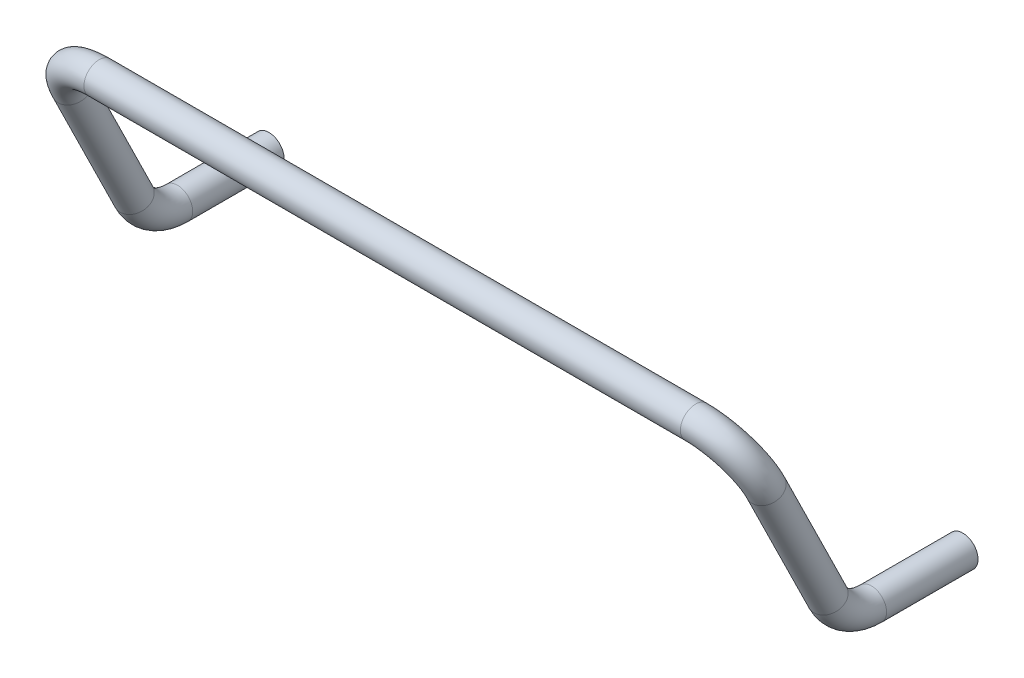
ISO-10303-21;
HEADER;
FILE_DESCRIPTION(('STEP AP214'),'2;1');
FILE_NAME('part.step','',(''),(''),'','','');
FILE_SCHEMA(('AUTOMOTIVE_DESIGN { 1 0 10303 214 1 1 1 1 }'));
ENDSEC;
DATA;
#1=APPLICATION_CONTEXT('core data for automotive mechanical design processes');
#2=APPLICATION_PROTOCOL_DEFINITION('international standard','automotive_design',2000,#1);
#3=PRODUCT_CONTEXT('',#1,'mechanical');
#4=PRODUCT('Part','Part','',(#3));
#5=PRODUCT_RELATED_PRODUCT_CATEGORY('part','',(#4));
#6=PRODUCT_DEFINITION_FORMATION('','',#4);
#7=PRODUCT_DEFINITION_CONTEXT('part definition',#1,'design');
#8=PRODUCT_DEFINITION('design','',#6,#7);
#9=PRODUCT_DEFINITION_SHAPE('','',#8);
#10=(LENGTH_UNIT() NAMED_UNIT(*) SI_UNIT(.MILLI.,.METRE.));
#11=(NAMED_UNIT(*) PLANE_ANGLE_UNIT() SI_UNIT($,.RADIAN.));
#12=(NAMED_UNIT(*) SI_UNIT($,.STERADIAN.) SOLID_ANGLE_UNIT());
#13=UNCERTAINTY_MEASURE_WITH_UNIT(LENGTH_MEASURE(1.E-05),#10,'distance_accuracy_value','');
#14=(GEOMETRIC_REPRESENTATION_CONTEXT(3) GLOBAL_UNCERTAINTY_ASSIGNED_CONTEXT((#13)) GLOBAL_UNIT_ASSIGNED_CONTEXT((#10,
#11,#12)) REPRESENTATION_CONTEXT('',''));
#15=CARTESIAN_POINT('',(0.,0.,0.));
#16=DIRECTION('',(0.,0.,1.));
#17=DIRECTION('',(1.,0.,0.));
#18=AXIS2_PLACEMENT_3D('',#15,#16,#17);
#19=CARTESIAN_POINT('',(40.,161.493988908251,179.49648763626));
#20=DIRECTION('',(1.,0.,0.));
#21=DIRECTION('',(0.,0.,-1.));
#22=AXIS2_PLACEMENT_3D('',#19,#20,#21);
#23=CYLINDRICAL_SURFACE('',#22,12.5);
#24=CARTESIAN_POINT('',(40.,161.493988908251,179.49648763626));
#25=DIRECTION('',(1.,0.,0.));
#26=DIRECTION('',(0.,-0.897188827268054,-0.441647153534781));
#27=AXIS2_PLACEMENT_3D('',#24,#25,#26);
#28=CIRCLE('',#27,12.5);
#29=CARTESIAN_POINT('',(40.,172.708849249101,185.017077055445));
#30=VERTEX_POINT('',#29);
#31=EDGE_CURVE('E10',#30,#30,#28,.T.);
#32=ORIENTED_EDGE('',*,*,#31,.T.);
#33=EDGE_LOOP('',(#32));
#34=FACE_BOUND('',#33,.T.);
#35=CARTESIAN_POINT('',(530.,161.49398890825,179.49648763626));
#36=DIRECTION('',(1.,0.,0.));
#37=DIRECTION('',(0.,-0.897188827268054,-0.441647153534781));
#38=AXIS2_PLACEMENT_3D('',#35,#36,#37);
#39=CIRCLE('',#38,12.5);
#40=CARTESIAN_POINT('',(530.,172.708849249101,185.017077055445));
#41=VERTEX_POINT('',#40);
#42=EDGE_CURVE('E69',#41,#41,#39,.T.);
#43=ORIENTED_EDGE('',*,*,#42,.F.);
#44=EDGE_LOOP('',(#43));
#45=FACE_BOUND('',#44,.T.);
#46=ADVANCED_FACE('F32',(#34,#45),#23,.T.);
#47=CARTESIAN_POINT('',(40.,161.493988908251,179.49648763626));
#48=DIRECTION('',(1.,0.,0.));
#49=DIRECTION('',(0.,0.,-1.));
#50=AXIS2_PLACEMENT_3D('',#47,#48,#49);
#51=CYLINDRICAL_SURFACE('',#50,11.);
#52=CARTESIAN_POINT('',(40.,161.493988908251,179.49648763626));
#53=DIRECTION('',(1.,0.,0.));
#54=DIRECTION('',(0.,-0.897188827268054,-0.441647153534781));
#55=AXIS2_PLACEMENT_3D('',#52,#53,#54);
#56=CIRCLE('',#55,11.);
#57=CARTESIAN_POINT('',(40.,171.363066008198,184.354606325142));
#58=VERTEX_POINT('',#57);
#59=EDGE_CURVE('E38',#58,#58,#56,.T.);
#60=ORIENTED_EDGE('',*,*,#59,.F.);
#61=EDGE_LOOP('',(#60));
#62=FACE_BOUND('',#61,.T.);
#63=CARTESIAN_POINT('',(530.,161.49398890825,179.49648763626));
#64=DIRECTION('',(1.,0.,0.));
#65=DIRECTION('',(0.,-0.897188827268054,-0.441647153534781));
#66=AXIS2_PLACEMENT_3D('',#63,#64,#65);
#67=CIRCLE('',#66,11.);
#68=CARTESIAN_POINT('',(530.,171.363066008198,184.354606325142));
#69=VERTEX_POINT('',#68);
#70=EDGE_CURVE('E72',#69,#69,#67,.T.);
#71=ORIENTED_EDGE('',*,*,#70,.T.);
#72=EDGE_LOOP('',(#71));
#73=FACE_BOUND('',#72,.T.);
#74=ADVANCED_FACE('F119',(#62,#73),#51,.F.);
#75=CARTESIAN_POINT('',(40.,125.606435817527,161.830601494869));
#76=DIRECTION('',(0.,0.441647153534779,-0.897188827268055));
#77=DIRECTION('',(0.,0.897188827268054,0.441647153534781));
#78=AXIS2_PLACEMENT_3D('',#75,#76,#77);
#79=TOROIDAL_SURFACE('',#78,40.,12.5);
#80=CARTESIAN_POINT('',(0.,125.606435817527,161.830601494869));
#81=DIRECTION('',(0.,0.897188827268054,0.44164715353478));
#82=DIRECTION('',(1.,0.,0.));
#83=AXIS2_PLACEMENT_3D('',#80,#81,#82);
#84=CIRCLE('',#83,12.5);
#85=CARTESIAN_POINT('',(-12.5,125.606435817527,161.830601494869));
#86=VERTEX_POINT('',#85);
#87=EDGE_CURVE('E42',#86,#86,#84,.T.);
#88=CARTESIAN_POINT('',(40.,125.606435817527,161.830601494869));
#89=DIRECTION('',(0.,0.441647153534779,-0.897188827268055));
#90=DIRECTION('',(0.,0.897188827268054,0.441647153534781));
#91=AXIS2_PLACEMENT_3D('',#88,#89,#90);
#92=CIRCLE('',#91,52.5);
#93=EDGE_CURVE('',#86,#30,#92,.T.);
#94=ORIENTED_EDGE('',*,*,#87,.T.);
#95=ORIENTED_EDGE('',*,*,#31,.F.);
#96=ORIENTED_EDGE('',*,*,#93,.T.);
#97=ORIENTED_EDGE('',*,*,#93,.F.);
#98=EDGE_LOOP('',(#94,#96,#95,#97));
#99=FACE_BOUND('',#98,.T.);
#100=ADVANCED_FACE('F123',(#99),#79,.T.);
#101=CARTESIAN_POINT('',(40.,125.606435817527,161.830601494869));
#102=DIRECTION('',(0.,0.441647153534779,-0.897188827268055));
#103=DIRECTION('',(0.,0.897188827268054,0.441647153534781));
#104=AXIS2_PLACEMENT_3D('',#101,#102,#103);
#105=TOROIDAL_SURFACE('',#104,40.,11.);
#106=CARTESIAN_POINT('',(0.,125.606435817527,161.830601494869));
#107=DIRECTION('',(0.,0.897188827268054,0.44164715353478));
#108=DIRECTION('',(1.,0.,0.));
#109=AXIS2_PLACEMENT_3D('',#106,#107,#108);
#110=CIRCLE('',#109,11.);
#111=CARTESIAN_POINT('',(-11.,125.606435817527,161.830601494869));
#112=VERTEX_POINT('',#111);
#113=EDGE_CURVE('E46',#112,#112,#110,.T.);
#114=CARTESIAN_POINT('',(40.,125.606435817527,161.830601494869));
#115=DIRECTION('',(0.,0.441647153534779,-0.897188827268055));
#116=DIRECTION('',(0.,0.897188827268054,0.441647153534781));
#117=AXIS2_PLACEMENT_3D('',#114,#115,#116);
#118=CIRCLE('',#117,51.);
#119=EDGE_CURVE('',#112,#58,#118,.T.);
#120=ORIENTED_EDGE('',*,*,#113,.F.);
#121=ORIENTED_EDGE('',*,*,#59,.T.);
#122=ORIENTED_EDGE('',*,*,#119,.T.);
#123=ORIENTED_EDGE('',*,*,#119,.F.);
#124=EDGE_LOOP('',(#120,#122,#121,#123));
#125=FACE_BOUND('',#124,.T.);
#126=ADVANCED_FACE('F169',(#125),#105,.F.);
#127=CARTESIAN_POINT('',(0.,22.3341138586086,110.994115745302));
#128=DIRECTION('',(0.,0.897188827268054,0.44164715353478));
#129=DIRECTION('',(0.,-0.441647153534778,0.897188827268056));
#130=AXIS2_PLACEMENT_3D('',#127,#128,#129);
#131=CYLINDRICAL_SURFACE('',#130,12.5);
#132=CARTESIAN_POINT('',(0.,22.3341138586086,110.994115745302));
#133=DIRECTION('',(0.,0.897188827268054,0.44164715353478));
#134=DIRECTION('',(1.,0.,0.));
#135=AXIS2_PLACEMENT_3D('',#132,#133,#134);
#136=CIRCLE('',#135,12.5);
#137=CARTESIAN_POINT('',(0.,16.8135244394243,122.208976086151));
#138=VERTEX_POINT('',#137);
#139=EDGE_CURVE('E51',#138,#138,#136,.T.);
#140=ORIENTED_EDGE('',*,*,#139,.T.);
#141=EDGE_LOOP('',(#140));
#142=FACE_BOUND('',#141,.T.);
#143=ORIENTED_EDGE('',*,*,#87,.F.);
#144=EDGE_LOOP('',(#143));
#145=FACE_BOUND('',#144,.T.);
#146=ADVANCED_FACE('F165',(#142,#145),#131,.T.);
#147=CARTESIAN_POINT('',(0.,22.3341138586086,110.994115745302));
#148=DIRECTION('',(0.,0.897188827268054,0.44164715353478));
#149=DIRECTION('',(0.,-0.441647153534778,0.897188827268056));
#150=AXIS2_PLACEMENT_3D('',#147,#148,#149);
#151=CYLINDRICAL_SURFACE('',#150,11.);
#152=CARTESIAN_POINT('',(0.,22.3341138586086,110.994115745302));
#153=DIRECTION('',(0.,0.897188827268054,0.44164715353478));
#154=DIRECTION('',(1.,0.,0.));
#155=AXIS2_PLACEMENT_3D('',#152,#153,#154);
#156=CIRCLE('',#155,11.);
#157=CARTESIAN_POINT('',(0.,17.4759951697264,120.863192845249));
#158=VERTEX_POINT('',#157);
#159=EDGE_CURVE('E54',#158,#158,#156,.T.);
#160=ORIENTED_EDGE('',*,*,#159,.F.);
#161=EDGE_LOOP('',(#160));
#162=FACE_BOUND('',#161,.T.);
#163=ORIENTED_EDGE('',*,*,#113,.T.);
#164=EDGE_LOOP('',(#163));
#165=FACE_BOUND('',#164,.T.);
#166=ADVANCED_FACE('F161',(#162,#165),#151,.F.);
#167=CARTESIAN_POINT('',(0.,40.0000000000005,75.1065626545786));
#168=DIRECTION('',(-1.,0.,0.));
#169=DIRECTION('',(0.,0.,1.));
#170=AXIS2_PLACEMENT_3D('',#167,#168,#169);
#171=TOROIDAL_SURFACE('',#170,40.,12.5);
#172=CARTESIAN_POINT('',(0.,2.22044604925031E-13,75.1065626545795));
#173=DIRECTION('',(0.,0.,1.));
#174=DIRECTION('',(1.,0.,0.));
#175=AXIS2_PLACEMENT_3D('',#172,#173,#174);
#176=CIRCLE('',#175,12.5);
#177=CARTESIAN_POINT('',(0.,-12.4999999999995,75.1065626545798));
#178=VERTEX_POINT('',#177);
#179=EDGE_CURVE('E57',#178,#178,#176,.T.);
#180=CARTESIAN_POINT('',(0.,40.0000000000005,75.1065626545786));
#181=DIRECTION('',(-1.,0.,0.));
#182=DIRECTION('',(0.,0.,1.));
#183=AXIS2_PLACEMENT_3D('',#180,#181,#182);
#184=CIRCLE('',#183,52.5);
#185=EDGE_CURVE('',#178,#138,#184,.T.);
#186=ORIENTED_EDGE('',*,*,#179,.T.);
#187=ORIENTED_EDGE('',*,*,#139,.F.);
#188=ORIENTED_EDGE('',*,*,#185,.T.);
#189=ORIENTED_EDGE('',*,*,#185,.F.);
#190=EDGE_LOOP('',(#186,#188,#187,#189));
#191=FACE_BOUND('',#190,.T.);
#192=ADVANCED_FACE('F157',(#191),#171,.T.);
#193=CARTESIAN_POINT('',(0.,40.0000000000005,75.1065626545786));
#194=DIRECTION('',(-1.,0.,0.));
#195=DIRECTION('',(0.,0.,1.));
#196=AXIS2_PLACEMENT_3D('',#193,#194,#195);
#197=TOROIDAL_SURFACE('',#196,40.,11.);
#198=CARTESIAN_POINT('',(0.,2.22044604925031E-13,75.1065626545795));
#199=DIRECTION('',(0.,0.,1.));
#200=DIRECTION('',(1.,0.,0.));
#201=AXIS2_PLACEMENT_3D('',#198,#199,#200);
#202=CIRCLE('',#201,11.);
#203=CARTESIAN_POINT('',(0.,-10.9999999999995,75.1065626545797));
#204=VERTEX_POINT('',#203);
#205=EDGE_CURVE('E60',#204,#204,#202,.T.);
#206=CARTESIAN_POINT('',(0.,40.0000000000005,75.1065626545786));
#207=DIRECTION('',(-1.,0.,0.));
#208=DIRECTION('',(0.,0.,1.));
#209=AXIS2_PLACEMENT_3D('',#206,#207,#208);
#210=CIRCLE('',#209,51.);
#211=EDGE_CURVE('',#204,#158,#210,.T.);
#212=ORIENTED_EDGE('',*,*,#205,.F.);
#213=ORIENTED_EDGE('',*,*,#159,.T.);
#214=ORIENTED_EDGE('',*,*,#211,.T.);
#215=ORIENTED_EDGE('',*,*,#211,.F.);
#216=EDGE_LOOP('',(#212,#214,#213,#215));
#217=FACE_BOUND('',#216,.T.);
#218=ADVANCED_FACE('F153',(#217),#197,.F.);
#219=CARTESIAN_POINT('',(0.,2.22044604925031E-13,75.1065626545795));
#220=DIRECTION('',(0.,0.,-1.));
#221=DIRECTION('',(-1.,0.,0.));
#222=AXIS2_PLACEMENT_3D('',#219,#220,#221);
#223=CYLINDRICAL_SURFACE('',#222,11.);
#224=ORIENTED_EDGE('',*,*,#205,.T.);
#225=EDGE_LOOP('',(#224));
#226=FACE_BOUND('',#225,.T.);
#227=CARTESIAN_POINT('',(0.,0.,0.));
#228=DIRECTION('',(0.,0.,1.));
#229=DIRECTION('',(1.,0.,0.));
#230=AXIS2_PLACEMENT_3D('',#227,#228,#229);
#231=CIRCLE('',#230,11.);
#232=CARTESIAN_POINT('',(11.,0.,0.));
#233=VERTEX_POINT('',#232);
#234=EDGE_CURVE('E66',#233,#233,#231,.T.);
#235=ORIENTED_EDGE('',*,*,#234,.F.);
#236=EDGE_LOOP('',(#235));
#237=FACE_BOUND('',#236,.T.);
#238=ADVANCED_FACE('F149',(#226,#237),#223,.F.);
#239=CARTESIAN_POINT('',(0.,2.22044604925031E-13,75.1065626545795));
#240=DIRECTION('',(0.,0.,-1.));
#241=DIRECTION('',(-1.,0.,0.));
#242=AXIS2_PLACEMENT_3D('',#239,#240,#241);
#243=CYLINDRICAL_SURFACE('',#242,12.5);
#244=ORIENTED_EDGE('',*,*,#179,.F.);
#245=EDGE_LOOP('',(#244));
#246=FACE_BOUND('',#245,.T.);
#247=CARTESIAN_POINT('',(0.,0.,0.));
#248=DIRECTION('',(0.,0.,1.));
#249=DIRECTION('',(1.,0.,0.));
#250=AXIS2_PLACEMENT_3D('',#247,#248,#249);
#251=CIRCLE('',#250,12.5);
#252=CARTESIAN_POINT('',(12.5,0.,0.));
#253=VERTEX_POINT('',#252);
#254=EDGE_CURVE('E63',#253,#253,#251,.T.);
#255=ORIENTED_EDGE('',*,*,#254,.T.);
#256=EDGE_LOOP('',(#255));
#257=FACE_BOUND('',#256,.T.);
#258=ADVANCED_FACE('F141',(#246,#257),#243,.T.);
#259=CARTESIAN_POINT('',(0.,0.,0.));
#260=DIRECTION('',(0.,0.,1.));
#261=DIRECTION('',(1.,0.,0.));
#262=AXIS2_PLACEMENT_3D('',#259,#260,#261);
#263=PLANE('',#262);
#264=ORIENTED_EDGE('',*,*,#234,.T.);
#265=EDGE_LOOP('',(#264));
#266=FACE_BOUND('',#265,.T.);
#267=ORIENTED_EDGE('',*,*,#254,.F.);
#268=EDGE_LOOP('',(#267));
#269=FACE_BOUND('',#268,.T.);
#270=ADVANCED_FACE('F131',(#266,#269),#263,.F.);
#271=CARTESIAN_POINT('',(530.,125.606435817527,161.830601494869));
#272=DIRECTION('',(0.,0.441647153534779,-0.897188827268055));
#273=DIRECTION('',(0.,0.897188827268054,0.441647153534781));
#274=AXIS2_PLACEMENT_3D('',#271,#272,#273);
#275=TOROIDAL_SURFACE('',#274,40.,12.5);
#276=CARTESIAN_POINT('',(570.,125.606435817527,161.830601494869));
#277=DIRECTION('',(0.,-0.897188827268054,-0.44164715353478));
#278=DIRECTION('',(-1.,0.,0.));
#279=AXIS2_PLACEMENT_3D('',#276,#277,#278);
#280=CIRCLE('',#279,12.5);
#281=CARTESIAN_POINT('',(582.5,125.606435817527,161.830601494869));
#282=VERTEX_POINT('',#281);
#283=EDGE_CURVE('E75',#282,#282,#280,.T.);
#284=CARTESIAN_POINT('',(530.,125.606435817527,161.830601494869));
#285=DIRECTION('',(0.,0.441647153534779,-0.897188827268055));
#286=DIRECTION('',(0.,0.897188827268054,0.441647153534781));
#287=AXIS2_PLACEMENT_3D('',#284,#285,#286);
#288=CIRCLE('',#287,52.5);
#289=EDGE_CURVE('',#41,#282,#288,.T.);
#290=ORIENTED_EDGE('',*,*,#42,.T.);
#291=ORIENTED_EDGE('',*,*,#283,.F.);
#292=ORIENTED_EDGE('',*,*,#289,.T.);
#293=ORIENTED_EDGE('',*,*,#289,.F.);
#294=EDGE_LOOP('',(#290,#292,#291,#293));
#295=FACE_BOUND('',#294,.T.);
#296=ADVANCED_FACE('F128',(#295),#275,.T.);
#297=CARTESIAN_POINT('',(530.,125.606435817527,161.830601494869));
#298=DIRECTION('',(0.,0.441647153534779,-0.897188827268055));
#299=DIRECTION('',(0.,0.897188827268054,0.441647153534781));
#300=AXIS2_PLACEMENT_3D('',#297,#298,#299);
#301=TOROIDAL_SURFACE('',#300,40.,11.);
#302=CARTESIAN_POINT('',(570.,125.606435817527,161.830601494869));
#303=DIRECTION('',(0.,-0.897188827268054,-0.44164715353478));
#304=DIRECTION('',(-1.,0.,0.));
#305=AXIS2_PLACEMENT_3D('',#302,#303,#304);
#306=CIRCLE('',#305,11.);
#307=CARTESIAN_POINT('',(581.,125.606435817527,161.830601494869));
#308=VERTEX_POINT('',#307);
#309=EDGE_CURVE('E78',#308,#308,#306,.T.);
#310=CARTESIAN_POINT('',(530.,125.606435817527,161.830601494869));
#311=DIRECTION('',(0.,0.441647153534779,-0.897188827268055));
#312=DIRECTION('',(0.,0.897188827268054,0.441647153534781));
#313=AXIS2_PLACEMENT_3D('',#310,#311,#312);
#314=CIRCLE('',#313,51.);
#315=EDGE_CURVE('',#69,#308,#314,.T.);
#316=ORIENTED_EDGE('',*,*,#70,.F.);
#317=ORIENTED_EDGE('',*,*,#309,.T.);
#318=ORIENTED_EDGE('',*,*,#315,.T.);
#319=ORIENTED_EDGE('',*,*,#315,.F.);
#320=EDGE_LOOP('',(#316,#318,#317,#319));
#321=FACE_BOUND('',#320,.T.);
#322=ADVANCED_FACE('F130',(#321),#301,.F.);
#323=CARTESIAN_POINT('',(570.,22.3341138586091,110.994115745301));
#324=DIRECTION('',(0.,0.897188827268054,0.44164715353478));
#325=DIRECTION('',(0.,-0.441647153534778,0.897188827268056));
#326=AXIS2_PLACEMENT_3D('',#323,#324,#325);
#327=CYLINDRICAL_SURFACE('',#326,12.5);
#328=CARTESIAN_POINT('',(570.,22.3341138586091,110.994115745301));
#329=DIRECTION('',(0.,-0.897188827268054,-0.44164715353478));
#330=DIRECTION('',(-1.,0.,0.));
#331=AXIS2_PLACEMENT_3D('',#328,#329,#330);
#332=CIRCLE('',#331,12.5);
#333=CARTESIAN_POINT('',(570.,16.8135244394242,122.208976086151));
#334=VERTEX_POINT('',#333);
#335=EDGE_CURVE('E81',#334,#334,#332,.T.);
#336=ORIENTED_EDGE('',*,*,#335,.F.);
#337=EDGE_LOOP('',(#336));
#338=FACE_BOUND('',#337,.T.);
#339=ORIENTED_EDGE('',*,*,#283,.T.);
#340=EDGE_LOOP('',(#339));
#341=FACE_BOUND('',#340,.T.);
#342=ADVANCED_FACE('F138',(#338,#341),#327,.T.);
#343=CARTESIAN_POINT('',(570.,22.3341138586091,110.994115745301));
#344=DIRECTION('',(0.,0.897188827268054,0.44164715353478));
#345=DIRECTION('',(0.,-0.441647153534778,0.897188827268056));
#346=AXIS2_PLACEMENT_3D('',#343,#344,#345);
#347=CYLINDRICAL_SURFACE('',#346,11.);
#348=CARTESIAN_POINT('',(570.,22.3341138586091,110.994115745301));
#349=DIRECTION('',(0.,-0.897188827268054,-0.44164715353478));
#350=DIRECTION('',(-1.,0.,0.));
#351=AXIS2_PLACEMENT_3D('',#348,#349,#350);
#352=CIRCLE('',#351,11.);
#353=CARTESIAN_POINT('',(570.,17.4759951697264,120.863192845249));
#354=VERTEX_POINT('',#353);
#355=EDGE_CURVE('E84',#354,#354,#352,.T.);
#356=ORIENTED_EDGE('',*,*,#355,.T.);
#357=EDGE_LOOP('',(#356));
#358=FACE_BOUND('',#357,.T.);
#359=ORIENTED_EDGE('',*,*,#309,.F.);
#360=EDGE_LOOP('',(#359));
#361=FACE_BOUND('',#360,.T.);
#362=ADVANCED_FACE('F236',(#358,#361),#347,.F.);
#363=CARTESIAN_POINT('',(570.,40.0000000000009,75.1065626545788));
#364=DIRECTION('',(1.,0.,0.));
#365=DIRECTION('',(0.,0.,1.));
#366=AXIS2_PLACEMENT_3D('',#363,#364,#365);
#367=TOROIDAL_SURFACE('',#366,40.,12.5);
#368=CARTESIAN_POINT('',(570.,8.88178419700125E-13,75.1065626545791));
#369=DIRECTION('',(0.,0.,-1.));
#370=DIRECTION('',(-1.,0.,0.));
#371=AXIS2_PLACEMENT_3D('',#368,#369,#370);
#372=CIRCLE('',#371,12.5);
#373=CARTESIAN_POINT('',(570.,-12.4999999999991,75.1065626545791));
#374=VERTEX_POINT('',#373);
#375=EDGE_CURVE('E87',#374,#374,#372,.T.);
#376=CARTESIAN_POINT('',(570.,40.0000000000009,75.1065626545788));
#377=DIRECTION('',(1.,0.,0.));
#378=DIRECTION('',(0.,0.,1.));
#379=AXIS2_PLACEMENT_3D('',#376,#377,#378);
#380=CIRCLE('',#379,52.5);
#381=EDGE_CURVE('',#334,#374,#380,.T.);
#382=ORIENTED_EDGE('',*,*,#335,.T.);
#383=ORIENTED_EDGE('',*,*,#375,.F.);
#384=ORIENTED_EDGE('',*,*,#381,.T.);
#385=ORIENTED_EDGE('',*,*,#381,.F.);
#386=EDGE_LOOP('',(#382,#384,#383,#385));
#387=FACE_BOUND('',#386,.T.);
#388=ADVANCED_FACE('F245',(#387),#367,.T.);
#389=CARTESIAN_POINT('',(570.,40.0000000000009,75.1065626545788));
#390=DIRECTION('',(1.,0.,0.));
#391=DIRECTION('',(0.,0.,1.));
#392=AXIS2_PLACEMENT_3D('',#389,#390,#391);
#393=TOROIDAL_SURFACE('',#392,40.,11.);
#394=CARTESIAN_POINT('',(570.,8.88178419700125E-13,75.1065626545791));
#395=DIRECTION('',(0.,0.,-1.));
#396=DIRECTION('',(-1.,0.,0.));
#397=AXIS2_PLACEMENT_3D('',#394,#395,#396);
#398=CIRCLE('',#397,11.);
#399=CARTESIAN_POINT('',(570.,-10.9999999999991,75.1065626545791));
#400=VERTEX_POINT('',#399);
#401=EDGE_CURVE('E90',#400,#400,#398,.T.);
#402=CARTESIAN_POINT('',(570.,40.0000000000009,75.1065626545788));
#403=DIRECTION('',(1.,0.,0.));
#404=DIRECTION('',(0.,0.,1.));
#405=AXIS2_PLACEMENT_3D('',#402,#403,#404);
#406=CIRCLE('',#405,51.);
#407=EDGE_CURVE('',#354,#400,#406,.T.);
#408=ORIENTED_EDGE('',*,*,#355,.F.);
#409=ORIENTED_EDGE('',*,*,#401,.T.);
#410=ORIENTED_EDGE('',*,*,#407,.T.);
#411=ORIENTED_EDGE('',*,*,#407,.F.);
#412=EDGE_LOOP('',(#408,#410,#409,#411));
#413=FACE_BOUND('',#412,.T.);
#414=ADVANCED_FACE('F115',(#413),#393,.F.);
#415=CARTESIAN_POINT('',(570.,8.88178419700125E-13,75.1065626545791));
#416=DIRECTION('',(0.,0.,-1.));
#417=DIRECTION('',(1.,0.,0.));
#418=AXIS2_PLACEMENT_3D('',#415,#416,#417);
#419=CYLINDRICAL_SURFACE('',#418,11.);
#420=ORIENTED_EDGE('',*,*,#401,.F.);
#421=EDGE_LOOP('',(#420));
#422=FACE_BOUND('',#421,.T.);
#423=CARTESIAN_POINT('',(570.,4.44089209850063E-13,-6.66133814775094E-13));
#424=DIRECTION('',(0.,0.,-1.));
#425=DIRECTION('',(-1.,0.,0.));
#426=AXIS2_PLACEMENT_3D('',#423,#424,#425);
#427=CIRCLE('',#426,11.);
#428=CARTESIAN_POINT('',(559.,4.3248737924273E-13,-6.5758509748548E-13));
#429=VERTEX_POINT('',#428);
#430=EDGE_CURVE('E96',#429,#429,#427,.T.);
#431=ORIENTED_EDGE('',*,*,#430,.T.);
#432=EDGE_LOOP('',(#431));
#433=FACE_BOUND('',#432,.T.);
#434=ADVANCED_FACE('F100',(#422,#433),#419,.F.);
#435=CARTESIAN_POINT('',(570.,8.88178419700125E-13,75.1065626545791));
#436=DIRECTION('',(0.,0.,-1.));
#437=DIRECTION('',(1.,0.,0.));
#438=AXIS2_PLACEMENT_3D('',#435,#436,#437);
#439=CYLINDRICAL_SURFACE('',#438,12.5);
#440=ORIENTED_EDGE('',*,*,#375,.T.);
#441=EDGE_LOOP('',(#440));
#442=FACE_BOUND('',#441,.T.);
#443=CARTESIAN_POINT('',(570.,4.44089209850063E-13,-6.66133814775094E-13));
#444=DIRECTION('',(0.,0.,-1.));
#445=DIRECTION('',(-1.,0.,0.));
#446=AXIS2_PLACEMENT_3D('',#443,#444,#445);
#447=CIRCLE('',#446,12.5);
#448=CARTESIAN_POINT('',(557.5,4.30905311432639E-13,-6.56419363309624E-13));
#449=VERTEX_POINT('',#448);
#450=EDGE_CURVE('E93',#449,#449,#447,.T.);
#451=ORIENTED_EDGE('',*,*,#450,.F.);
#452=EDGE_LOOP('',(#451));
#453=FACE_BOUND('',#452,.T.);
#454=ADVANCED_FACE('F105',(#442,#453),#439,.T.);
#455=CARTESIAN_POINT('',(570.,4.44089209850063E-13,-6.66133814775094E-13));
#456=DIRECTION('',(0.,0.,1.));
#457=DIRECTION('',(-1.,0.,0.));
#458=AXIS2_PLACEMENT_3D('',#455,#456,#457);
#459=PLANE('',#458);
#460=ORIENTED_EDGE('',*,*,#430,.F.);
#461=EDGE_LOOP('',(#460));
#462=FACE_BOUND('',#461,.T.);
#463=ORIENTED_EDGE('',*,*,#450,.T.);
#464=EDGE_LOOP('',(#463));
#465=FACE_BOUND('',#464,.T.);
#466=ADVANCED_FACE('F102',(#462,#465),#459,.F.);
#467=CLOSED_SHELL('',(#46,#74,#100,#126,#146,#166,#192,#218,#238,#258,#270,#296,#322,#342,#362,
#388,#414,#434,#454,#466));
#468=MANIFOLD_SOLID_BREP('B2',#467);
#469=ADVANCED_BREP_SHAPE_REPRESENTATION('',(#18,#468),#14);
#470=SHAPE_DEFINITION_REPRESENTATION(#9,#469);
ENDSEC;
END-ISO-10303-21;
